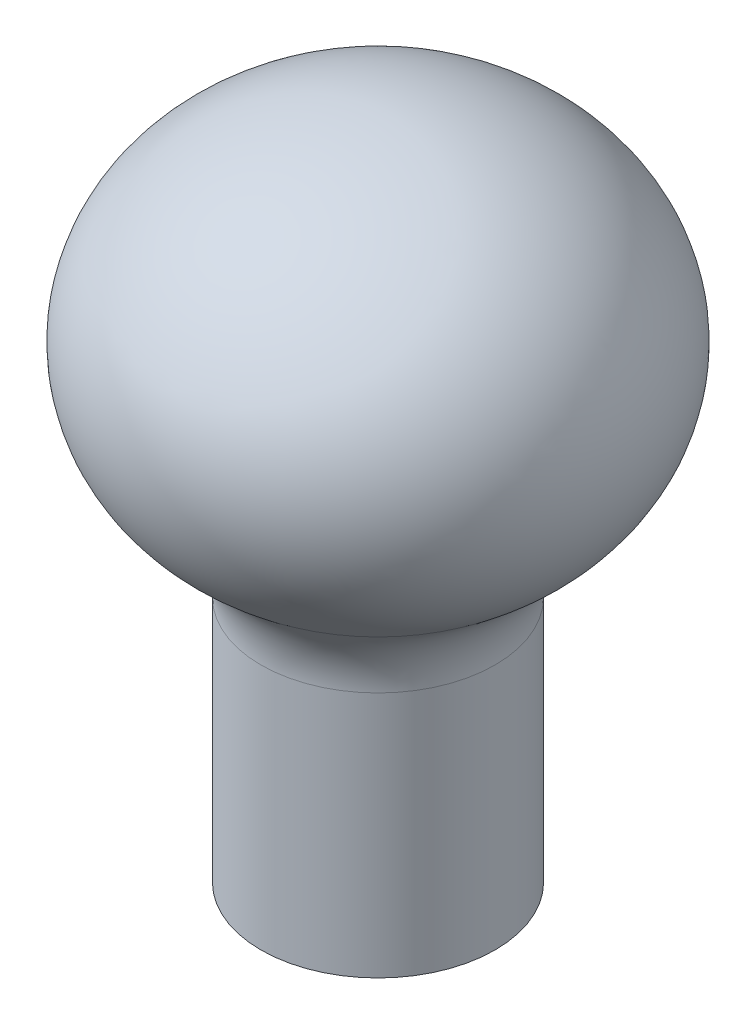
from build123d import *

# Parameters (mm, degrees)
FILLET1_R = 6


with BuildPart() as part:
    # Sketch1 → Revolve1 (revolve)
    with BuildSketch(Plane.XY, mode=Mode.PRIVATE) as revolve1_sk:
        with BuildLine():
            Line((7.5, 0), (7.5, 19.174682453))
            add(Edge.make_bspline(
                [(7.5, 19.174682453), (17.467869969, 23.970476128), (14.488887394, 33.235238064), (11.50990482, 42.5), (0, 42.5)],
                knots=[2.094395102, 2.094395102, 2.094395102, 3.403392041, 3.403392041, 4.71238898, 4.71238898, 4.71238898], degree=2, weights=[1, 0.79335334, 1, 0.79335334, 1]))
            Line((0, 42.5), (0, 0))
            Line((0, 0), (7.5, 0))
        make_face()
    revolve(revolve1_sk.sketch.rotate(Axis((0, 0, 0), (0, 1, 0)), 90), axis=Axis((0, 0, 0), (0, 1, 0)))

    # Fillet1
    fillet1_edges = [part.edges().sort_by_distance(p)[0] for p in [
        (0, 19.174682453, 7.5),
    ]]
    fillet(fillet1_edges, radius=FILLET1_R)


solid = part.part
